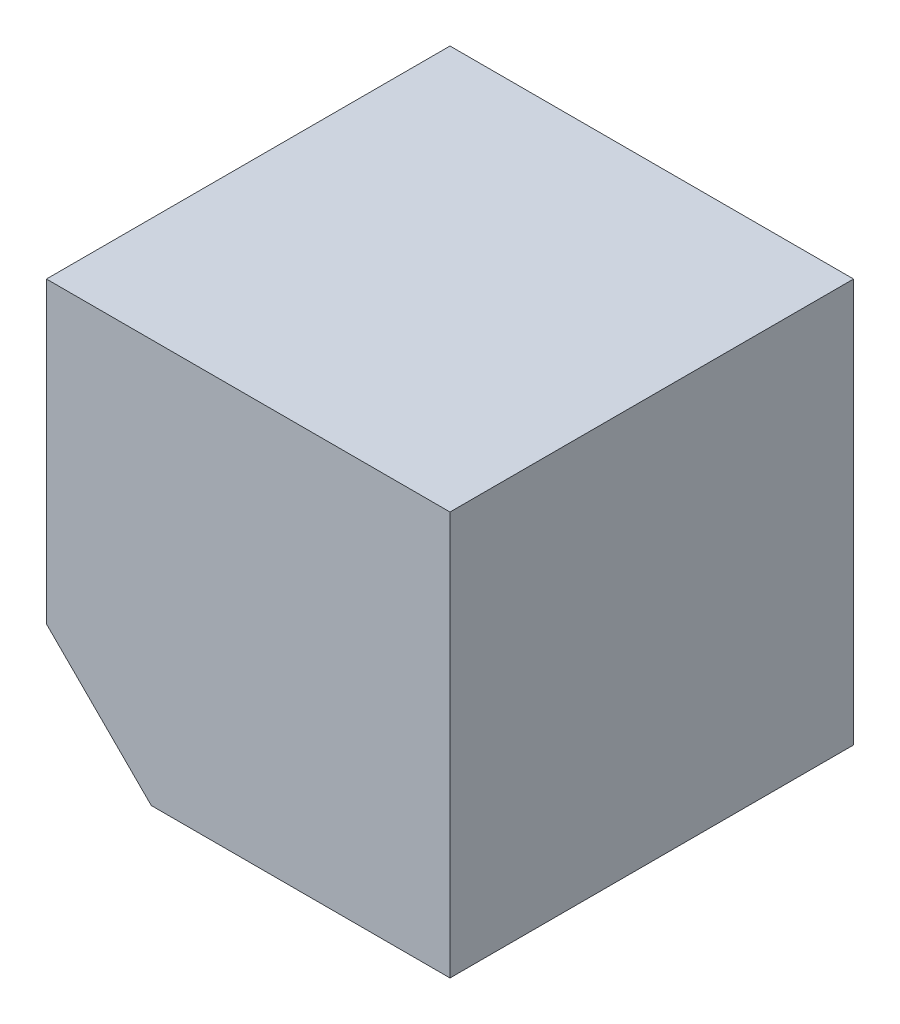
ISO-10303-21;
HEADER;
FILE_DESCRIPTION(('STEP AP214'),'2;1');
FILE_NAME('part.step','',(''),(''),'','','');
FILE_SCHEMA(('AUTOMOTIVE_DESIGN { 1 0 10303 214 1 1 1 1 }'));
ENDSEC;
DATA;
#1=APPLICATION_CONTEXT('core data for automotive mechanical design processes');
#2=APPLICATION_PROTOCOL_DEFINITION('international standard','automotive_design',2000,#1);
#3=PRODUCT_CONTEXT('',#1,'mechanical');
#4=PRODUCT('Part','Part','',(#3));
#5=PRODUCT_RELATED_PRODUCT_CATEGORY('part','',(#4));
#6=PRODUCT_DEFINITION_FORMATION('','',#4);
#7=PRODUCT_DEFINITION_CONTEXT('part definition',#1,'design');
#8=PRODUCT_DEFINITION('design','',#6,#7);
#9=PRODUCT_DEFINITION_SHAPE('','',#8);
#10=(LENGTH_UNIT() NAMED_UNIT(*) SI_UNIT(.MILLI.,.METRE.));
#11=(NAMED_UNIT(*) PLANE_ANGLE_UNIT() SI_UNIT($,.RADIAN.));
#12=(NAMED_UNIT(*) SI_UNIT($,.STERADIAN.) SOLID_ANGLE_UNIT());
#13=UNCERTAINTY_MEASURE_WITH_UNIT(LENGTH_MEASURE(1.E-05),#10,'distance_accuracy_value','');
#14=(GEOMETRIC_REPRESENTATION_CONTEXT(3) GLOBAL_UNCERTAINTY_ASSIGNED_CONTEXT((#13)) GLOBAL_UNIT_ASSIGNED_CONTEXT((#10,
#11,#12)) REPRESENTATION_CONTEXT('',''));
#15=CARTESIAN_POINT('',(0.,0.,0.));
#16=DIRECTION('',(0.,0.,1.));
#17=DIRECTION('',(1.,0.,0.));
#18=AXIS2_PLACEMENT_3D('',#15,#16,#17);
#19=CARTESIAN_POINT('',(0.,0.,100.));
#20=DIRECTION('',(1.,0.,0.));
#21=DIRECTION('',(0.,0.,-1.));
#22=AXIS2_PLACEMENT_3D('',#19,#20,#21);
#23=PLANE('',#22);
#24=DIRECTION('',(0.,0.,-1.));
#25=VECTOR('',#24,1.);
#26=CARTESIAN_POINT('',(0.,0.,100.));
#27=LINE('',#26,#25);
#28=CARTESIAN_POINT('',(0.,0.,74.0192378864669));
#29=VERTEX_POINT('',#28);
#30=CARTESIAN_POINT('',(0.,0.,0.));
#31=VERTEX_POINT('',#30);
#32=EDGE_CURVE('E41',#29,#31,#27,.T.);
#33=ORIENTED_EDGE('',*,*,#32,.F.);
#34=DIRECTION('',(0.,0.707106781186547,0.707106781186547));
#35=VECTOR('',#34,1.);
#36=CARTESIAN_POINT('',(0.,12.9903810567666,87.0096189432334));
#37=LINE('',#36,#35);
#38=CARTESIAN_POINT('',(0.,25.9807621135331,100.));
#39=VERTEX_POINT('',#38);
#40=EDGE_CURVE('E87',#29,#39,#37,.T.);
#41=ORIENTED_EDGE('',*,*,#40,.T.);
#42=DIRECTION('',(0.,-1.,0.));
#43=VECTOR('',#42,1.);
#44=CARTESIAN_POINT('',(0.,0.,100.));
#45=LINE('',#44,#43);
#46=CARTESIAN_POINT('',(0.,100.,100.));
#47=VERTEX_POINT('',#46);
#48=EDGE_CURVE('E91',#47,#39,#45,.T.);
#49=ORIENTED_EDGE('',*,*,#48,.F.);
#50=DIRECTION('',(0.,0.,-1.));
#51=VECTOR('',#50,1.);
#52=CARTESIAN_POINT('',(0.,100.,100.));
#53=LINE('',#52,#51);
#54=CARTESIAN_POINT('',(0.,100.,0.));
#55=VERTEX_POINT('',#54);
#56=EDGE_CURVE('E105',#47,#55,#53,.T.);
#57=ORIENTED_EDGE('',*,*,#56,.T.);
#58=DIRECTION('',(0.,-1.,0.));
#59=VECTOR('',#58,1.);
#60=CARTESIAN_POINT('',(0.,0.,0.));
#61=LINE('',#60,#59);
#62=EDGE_CURVE('E93',#55,#31,#61,.T.);
#63=ORIENTED_EDGE('',*,*,#62,.T.);
#64=EDGE_LOOP('',(#33,#41,#49,#57,#63));
#65=FACE_BOUND('',#64,.T.);
#66=ADVANCED_FACE('F34',(#65),#23,.F.);
#67=CARTESIAN_POINT('',(0.,0.,100.));
#68=DIRECTION('',(0.,1.,0.));
#69=DIRECTION('',(0.,0.,1.));
#70=AXIS2_PLACEMENT_3D('',#67,#68,#69);
#71=PLANE('',#70);
#72=DIRECTION('',(1.,0.,0.));
#73=VECTOR('',#72,1.);
#74=CARTESIAN_POINT('',(0.,0.,100.));
#75=LINE('',#74,#73);
#76=CARTESIAN_POINT('',(25.9807621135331,0.,100.));
#77=VERTEX_POINT('',#76);
#78=CARTESIAN_POINT('',(100.,0.,100.));
#79=VERTEX_POINT('',#78);
#80=EDGE_CURVE('E80',#77,#79,#75,.T.);
#81=ORIENTED_EDGE('',*,*,#80,.F.);
#82=DIRECTION('',(-0.707106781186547,0.,-0.707106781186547));
#83=VECTOR('',#82,1.);
#84=CARTESIAN_POINT('',(12.9903810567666,0.,87.0096189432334));
#85=LINE('',#84,#83);
#86=EDGE_CURVE('E48',#77,#29,#85,.T.);
#87=ORIENTED_EDGE('',*,*,#86,.T.);
#88=ORIENTED_EDGE('',*,*,#32,.T.);
#89=DIRECTION('',(1.,0.,0.));
#90=VECTOR('',#89,1.);
#91=CARTESIAN_POINT('',(0.,0.,0.));
#92=LINE('',#91,#90);
#93=CARTESIAN_POINT('',(100.,0.,0.));
#94=VERTEX_POINT('',#93);
#95=EDGE_CURVE('E107',#31,#94,#92,.T.);
#96=ORIENTED_EDGE('',*,*,#95,.T.);
#97=DIRECTION('',(0.,0.,-1.));
#98=VECTOR('',#97,1.);
#99=CARTESIAN_POINT('',(100.,0.,100.));
#100=LINE('',#99,#98);
#101=EDGE_CURVE('E113',#79,#94,#100,.T.);
#102=ORIENTED_EDGE('',*,*,#101,.F.);
#103=EDGE_LOOP('',(#81,#87,#88,#96,#102));
#104=FACE_BOUND('',#103,.T.);
#105=ADVANCED_FACE('F117',(#104),#71,.F.);
#106=CARTESIAN_POINT('',(100.,0.,100.));
#107=DIRECTION('',(-1.,0.,0.));
#108=DIRECTION('',(0.,0.,1.));
#109=AXIS2_PLACEMENT_3D('',#106,#107,#108);
#110=PLANE('',#109);
#111=DIRECTION('',(0.,1.,0.));
#112=VECTOR('',#111,1.);
#113=CARTESIAN_POINT('',(100.,0.,0.));
#114=LINE('',#113,#112);
#115=CARTESIAN_POINT('',(100.,100.,0.));
#116=VERTEX_POINT('',#115);
#117=EDGE_CURVE('E99',#94,#116,#114,.T.);
#118=ORIENTED_EDGE('',*,*,#117,.T.);
#119=DIRECTION('',(0.,0.,-1.));
#120=VECTOR('',#119,1.);
#121=CARTESIAN_POINT('',(100.,100.,100.));
#122=LINE('',#121,#120);
#123=CARTESIAN_POINT('',(100.,100.,100.));
#124=VERTEX_POINT('',#123);
#125=EDGE_CURVE('E111',#124,#116,#122,.T.);
#126=ORIENTED_EDGE('',*,*,#125,.F.);
#127=DIRECTION('',(0.,1.,0.));
#128=VECTOR('',#127,1.);
#129=CARTESIAN_POINT('',(100.,0.,100.));
#130=LINE('',#129,#128);
#131=EDGE_CURVE('E97',#79,#124,#130,.T.);
#132=ORIENTED_EDGE('',*,*,#131,.F.);
#133=ORIENTED_EDGE('',*,*,#101,.T.);
#134=EDGE_LOOP('',(#118,#126,#132,#133));
#135=FACE_BOUND('',#134,.T.);
#136=ADVANCED_FACE('F126',(#135),#110,.F.);
#137=CARTESIAN_POINT('',(0.,100.,100.));
#138=DIRECTION('',(0.,-1.,0.));
#139=DIRECTION('',(0.,0.,-1.));
#140=AXIS2_PLACEMENT_3D('',#137,#138,#139);
#141=PLANE('',#140);
#142=DIRECTION('',(-1.,0.,0.));
#143=VECTOR('',#142,1.);
#144=CARTESIAN_POINT('',(0.,100.,0.));
#145=LINE('',#144,#143);
#146=EDGE_CURVE('E76',#116,#55,#145,.T.);
#147=ORIENTED_EDGE('',*,*,#146,.T.);
#148=ORIENTED_EDGE('',*,*,#56,.F.);
#149=DIRECTION('',(-1.,0.,0.));
#150=VECTOR('',#149,1.);
#151=CARTESIAN_POINT('',(0.,100.,100.));
#152=LINE('',#151,#150);
#153=EDGE_CURVE('E56',#124,#47,#152,.T.);
#154=ORIENTED_EDGE('',*,*,#153,.F.);
#155=ORIENTED_EDGE('',*,*,#125,.T.);
#156=EDGE_LOOP('',(#147,#148,#154,#155));
#157=FACE_BOUND('',#156,.T.);
#158=ADVANCED_FACE('F122',(#157),#141,.F.);
#159=CARTESIAN_POINT('',(0.,100.,100.));
#160=DIRECTION('',(0.,0.,-1.));
#161=DIRECTION('',(-1.,0.,0.));
#162=AXIS2_PLACEMENT_3D('',#159,#160,#161);
#163=PLANE('',#162);
#164=ORIENTED_EDGE('',*,*,#48,.T.);
#165=DIRECTION('',(0.707106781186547,-0.707106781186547,0.));
#166=VECTOR('',#165,1.);
#167=CARTESIAN_POINT('',(-37.0096189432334,62.9903810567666,100.));
#168=LINE('',#167,#166);
#169=EDGE_CURVE('E12',#39,#77,#168,.T.);
#170=ORIENTED_EDGE('',*,*,#169,.T.);
#171=ORIENTED_EDGE('',*,*,#80,.T.);
#172=ORIENTED_EDGE('',*,*,#131,.T.);
#173=ORIENTED_EDGE('',*,*,#153,.T.);
#174=EDGE_LOOP('',(#164,#170,#171,#172,#173));
#175=FACE_BOUND('',#174,.T.);
#176=ADVANCED_FACE('F95',(#175),#163,.F.);
#177=CARTESIAN_POINT('',(0.,100.,0.));
#178=DIRECTION('',(0.,0.,-1.));
#179=DIRECTION('',(-1.,0.,0.));
#180=AXIS2_PLACEMENT_3D('',#177,#178,#179);
#181=PLANE('',#180);
#182=ORIENTED_EDGE('',*,*,#62,.F.);
#183=ORIENTED_EDGE('',*,*,#146,.F.);
#184=ORIENTED_EDGE('',*,*,#117,.F.);
#185=ORIENTED_EDGE('',*,*,#95,.F.);
#186=EDGE_LOOP('',(#182,#183,#184,#185));
#187=FACE_BOUND('',#186,.T.);
#188=ADVANCED_FACE('F121',(#187),#181,.T.);
#189=CARTESIAN_POINT('',(-24.673079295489,-24.673079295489,24.673079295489));
#190=DIRECTION('',(0.577350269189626,0.577350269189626,-0.577350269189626));
#191=DIRECTION('',(-0.707106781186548,0.,-0.707106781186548));
#192=AXIS2_PLACEMENT_3D('',#189,#190,#191);
#193=PLANE('',#192);
#194=ORIENTED_EDGE('',*,*,#40,.F.);
#195=ORIENTED_EDGE('',*,*,#86,.F.);
#196=ORIENTED_EDGE('',*,*,#169,.F.);
#197=EDGE_LOOP('',(#194,#195,#196));
#198=FACE_BOUND('',#197,.T.);
#199=ADVANCED_FACE('F86',(#198),#193,.F.);
#200=CLOSED_SHELL('',(#66,#105,#136,#158,#176,#188,#199));
#201=MANIFOLD_SOLID_BREP('B2',#200);
#202=ADVANCED_BREP_SHAPE_REPRESENTATION('',(#18,#201),#14);
#203=SHAPE_DEFINITION_REPRESENTATION(#9,#202);
ENDSEC;
END-ISO-10303-21;
